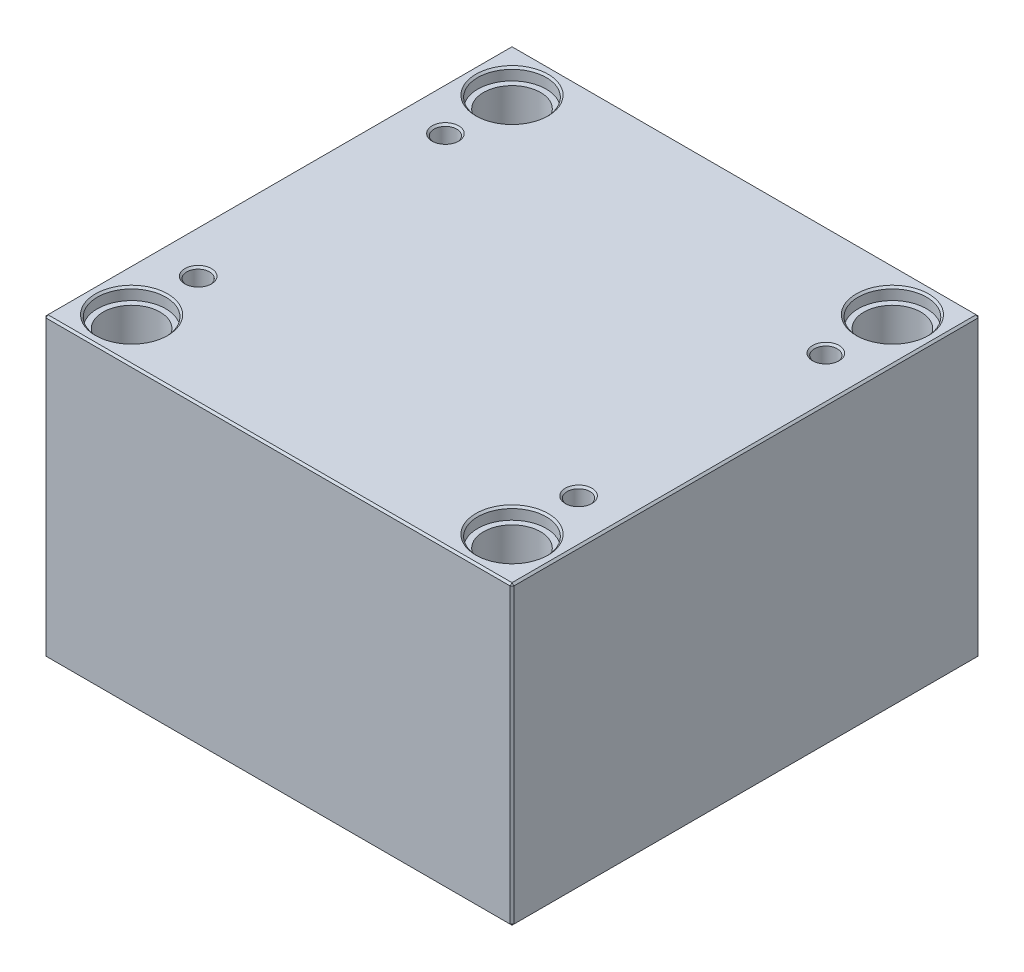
ISO-10303-21;
HEADER;
FILE_DESCRIPTION(('STEP AP214'),'2;1');
FILE_NAME('part.step','',(''),(''),'','','');
FILE_SCHEMA(('AUTOMOTIVE_DESIGN { 1 0 10303 214 1 1 1 1 }'));
ENDSEC;
DATA;
#1=APPLICATION_CONTEXT('core data for automotive mechanical design processes');
#2=APPLICATION_PROTOCOL_DEFINITION('international standard','automotive_design',2000,#1);
#3=PRODUCT_CONTEXT('',#1,'mechanical');
#4=PRODUCT('Part','Part','',(#3));
#5=PRODUCT_RELATED_PRODUCT_CATEGORY('part','',(#4));
#6=PRODUCT_DEFINITION_FORMATION('','',#4);
#7=PRODUCT_DEFINITION_CONTEXT('part definition',#1,'design');
#8=PRODUCT_DEFINITION('design','',#6,#7);
#9=PRODUCT_DEFINITION_SHAPE('','',#8);
#10=(LENGTH_UNIT() NAMED_UNIT(*) SI_UNIT(.MILLI.,.METRE.));
#11=(NAMED_UNIT(*) PLANE_ANGLE_UNIT() SI_UNIT($,.RADIAN.));
#12=(NAMED_UNIT(*) SI_UNIT($,.STERADIAN.) SOLID_ANGLE_UNIT());
#13=UNCERTAINTY_MEASURE_WITH_UNIT(LENGTH_MEASURE(1.E-05),#10,'distance_accuracy_value','');
#14=(GEOMETRIC_REPRESENTATION_CONTEXT(3) GLOBAL_UNCERTAINTY_ASSIGNED_CONTEXT((#13)) GLOBAL_UNIT_ASSIGNED_CONTEXT((#10,
#11,#12)) REPRESENTATION_CONTEXT('',''));
#15=CARTESIAN_POINT('',(0.,0.,0.));
#16=DIRECTION('',(0.,0.,1.));
#17=DIRECTION('',(1.,0.,0.));
#18=AXIS2_PLACEMENT_3D('',#15,#16,#17);
#19=CARTESIAN_POINT('',(-100.,0.,-100.));
#20=DIRECTION('',(0.,1.,0.));
#21=DIRECTION('',(0.,0.,1.));
#22=AXIS2_PLACEMENT_3D('',#19,#20,#21);
#23=CYLINDRICAL_SURFACE('',#22,15.);
#24=CARTESIAN_POINT('',(-100.,1.00000000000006,-100.));
#25=DIRECTION('',(0.,1.,0.));
#26=DIRECTION('',(0.,0.,1.));
#27=AXIS2_PLACEMENT_3D('',#24,#25,#26);
#28=CIRCLE('',#27,15.);
#29=CARTESIAN_POINT('',(-100.,1.00000000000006,-85.));
#30=VERTEX_POINT('',#29);
#31=EDGE_CURVE('E472',#30,#30,#28,.F.);
#32=ORIENTED_EDGE('',*,*,#31,.T.);
#33=EDGE_LOOP('',(#32));
#34=FACE_BOUND('',#33,.T.);
#35=CARTESIAN_POINT('',(-100.,149.7,-100.));
#36=DIRECTION('',(0.,1.,0.));
#37=DIRECTION('',(0.,0.,1.));
#38=AXIS2_PLACEMENT_3D('',#35,#36,#37);
#39=CIRCLE('',#38,15.);
#40=CARTESIAN_POINT('',(-100.,149.7,-85.));
#41=VERTEX_POINT('',#40);
#42=EDGE_CURVE('E221',#41,#41,#39,.F.);
#43=ORIENTED_EDGE('',*,*,#42,.F.);
#44=EDGE_LOOP('',(#43));
#45=FACE_BOUND('',#44,.T.);
#46=ADVANCED_FACE('F16',(#34,#45),#23,.F.);
#47=CARTESIAN_POINT('',(100.,0.,-100.));
#48=DIRECTION('',(0.,1.,0.));
#49=DIRECTION('',(0.,0.,1.));
#50=AXIS2_PLACEMENT_3D('',#47,#48,#49);
#51=CYLINDRICAL_SURFACE('',#50,15.);
#52=CARTESIAN_POINT('',(100.,1.00000000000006,-100.));
#53=DIRECTION('',(0.,1.,0.));
#54=DIRECTION('',(0.,0.,1.));
#55=AXIS2_PLACEMENT_3D('',#52,#53,#54);
#56=CIRCLE('',#55,15.);
#57=CARTESIAN_POINT('',(100.,1.00000000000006,-85.));
#58=VERTEX_POINT('',#57);
#59=EDGE_CURVE('E474',#58,#58,#56,.F.);
#60=ORIENTED_EDGE('',*,*,#59,.T.);
#61=EDGE_LOOP('',(#60));
#62=FACE_BOUND('',#61,.T.);
#63=CARTESIAN_POINT('',(100.,149.7,-100.));
#64=DIRECTION('',(0.,1.,0.));
#65=DIRECTION('',(0.,0.,1.));
#66=AXIS2_PLACEMENT_3D('',#63,#64,#65);
#67=CIRCLE('',#66,15.);
#68=CARTESIAN_POINT('',(100.,149.7,-85.));
#69=VERTEX_POINT('',#68);
#70=EDGE_CURVE('E218',#69,#69,#67,.F.);
#71=ORIENTED_EDGE('',*,*,#70,.F.);
#72=EDGE_LOOP('',(#71));
#73=FACE_BOUND('',#72,.T.);
#74=ADVANCED_FACE('F263',(#62,#73),#51,.F.);
#75=CARTESIAN_POINT('',(100.,0.,100.));
#76=DIRECTION('',(0.,1.,0.));
#77=DIRECTION('',(0.,0.,1.));
#78=AXIS2_PLACEMENT_3D('',#75,#76,#77);
#79=CYLINDRICAL_SURFACE('',#78,15.);
#80=CARTESIAN_POINT('',(100.,1.00000000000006,100.));
#81=DIRECTION('',(0.,1.,0.));
#82=DIRECTION('',(0.,0.,1.));
#83=AXIS2_PLACEMENT_3D('',#80,#81,#82);
#84=CIRCLE('',#83,15.);
#85=CARTESIAN_POINT('',(100.,1.00000000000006,115.));
#86=VERTEX_POINT('',#85);
#87=EDGE_CURVE('E477',#86,#86,#84,.F.);
#88=ORIENTED_EDGE('',*,*,#87,.T.);
#89=EDGE_LOOP('',(#88));
#90=FACE_BOUND('',#89,.T.);
#91=CARTESIAN_POINT('',(100.,149.7,100.));
#92=DIRECTION('',(0.,1.,0.));
#93=DIRECTION('',(0.,0.,1.));
#94=AXIS2_PLACEMENT_3D('',#91,#92,#93);
#95=CIRCLE('',#94,15.);
#96=CARTESIAN_POINT('',(100.,149.7,115.));
#97=VERTEX_POINT('',#96);
#98=EDGE_CURVE('E214',#97,#97,#95,.F.);
#99=ORIENTED_EDGE('',*,*,#98,.F.);
#100=EDGE_LOOP('',(#99));
#101=FACE_BOUND('',#100,.T.);
#102=ADVANCED_FACE('F270',(#90,#101),#79,.F.);
#103=CARTESIAN_POINT('',(-100.,0.,100.));
#104=DIRECTION('',(0.,1.,0.));
#105=DIRECTION('',(0.,0.,1.));
#106=AXIS2_PLACEMENT_3D('',#103,#104,#105);
#107=CYLINDRICAL_SURFACE('',#106,15.);
#108=CARTESIAN_POINT('',(-100.,1.,100.));
#109=DIRECTION('',(0.,1.,0.));
#110=DIRECTION('',(0.,0.,1.));
#111=AXIS2_PLACEMENT_3D('',#108,#109,#110);
#112=CIRCLE('',#111,15.);
#113=CARTESIAN_POINT('',(-100.,1.,115.));
#114=VERTEX_POINT('',#113);
#115=EDGE_CURVE('E480',#114,#114,#112,.F.);
#116=ORIENTED_EDGE('',*,*,#115,.T.);
#117=EDGE_LOOP('',(#116));
#118=FACE_BOUND('',#117,.T.);
#119=CARTESIAN_POINT('',(-100.,149.7,100.));
#120=DIRECTION('',(0.,1.,0.));
#121=DIRECTION('',(0.,0.,1.));
#122=AXIS2_PLACEMENT_3D('',#119,#120,#121);
#123=CIRCLE('',#122,15.);
#124=CARTESIAN_POINT('',(-100.,149.7,115.));
#125=VERTEX_POINT('',#124);
#126=EDGE_CURVE('E211',#125,#125,#123,.F.);
#127=ORIENTED_EDGE('',*,*,#126,.F.);
#128=EDGE_LOOP('',(#127));
#129=FACE_BOUND('',#128,.T.);
#130=ADVANCED_FACE('F277',(#118,#129),#107,.F.);
#131=CARTESIAN_POINT('',(-123.,156.,123.));
#132=DIRECTION('',(1.,0.,0.));
#133=DIRECTION('',(0.,0.,-1.));
#134=AXIS2_PLACEMENT_3D('',#131,#132,#133);
#135=PLANE('',#134);
#136=DIRECTION('',(0.,-1.,0.));
#137=VECTOR('',#136,1.);
#138=CARTESIAN_POINT('',(-123.,156.,-122.));
#139=LINE('',#138,#137);
#140=CARTESIAN_POINT('',(-123.,155.,-122.));
#141=VERTEX_POINT('',#140);
#142=CARTESIAN_POINT('',(-123.,1.,-122.));
#143=VERTEX_POINT('',#142);
#144=EDGE_CURVE('E487',#141,#143,#139,.T.);
#145=ORIENTED_EDGE('',*,*,#144,.T.);
#146=DIRECTION('',(0.,0.,1.));
#147=VECTOR('',#146,1.);
#148=CARTESIAN_POINT('',(-123.,1.,123.));
#149=LINE('',#148,#147);
#150=CARTESIAN_POINT('',(-123.,1.,122.));
#151=VERTEX_POINT('',#150);
#152=EDGE_CURVE('E490',#143,#151,#149,.T.);
#153=ORIENTED_EDGE('',*,*,#152,.T.);
#154=DIRECTION('',(0.,1.,0.));
#155=VECTOR('',#154,1.);
#156=CARTESIAN_POINT('',(-123.,156.,122.));
#157=LINE('',#156,#155);
#158=CARTESIAN_POINT('',(-123.,155.,122.));
#159=VERTEX_POINT('',#158);
#160=EDGE_CURVE('E485',#151,#159,#157,.T.);
#161=ORIENTED_EDGE('',*,*,#160,.T.);
#162=DIRECTION('',(0.,0.,-1.));
#163=VECTOR('',#162,1.);
#164=CARTESIAN_POINT('',(-123.,155.,-123.));
#165=LINE('',#164,#163);
#166=EDGE_CURVE('E483',#159,#141,#165,.T.);
#167=ORIENTED_EDGE('',*,*,#166,.T.);
#168=EDGE_LOOP('',(#145,#153,#161,#167));
#169=FACE_BOUND('',#168,.T.);
#170=ADVANCED_FACE('F298',(#169),#135,.F.);
#171=CARTESIAN_POINT('',(123.,156.,123.));
#172=DIRECTION('',(0.,0.,-1.));
#173=DIRECTION('',(-1.,0.,0.));
#174=AXIS2_PLACEMENT_3D('',#171,#172,#173);
#175=PLANE('',#174);
#176=DIRECTION('',(-1.,0.,0.));
#177=VECTOR('',#176,1.);
#178=CARTESIAN_POINT('',(-123.,155.,123.));
#179=LINE('',#178,#177);
#180=CARTESIAN_POINT('',(122.,155.,123.));
#181=VERTEX_POINT('',#180);
#182=CARTESIAN_POINT('',(-122.,155.,123.));
#183=VERTEX_POINT('',#182);
#184=EDGE_CURVE('E509',#181,#183,#179,.T.);
#185=ORIENTED_EDGE('',*,*,#184,.T.);
#186=DIRECTION('',(0.,-1.,0.));
#187=VECTOR('',#186,1.);
#188=CARTESIAN_POINT('',(-122.,156.,123.));
#189=LINE('',#188,#187);
#190=CARTESIAN_POINT('',(-122.,1.,123.));
#191=VERTEX_POINT('',#190);
#192=EDGE_CURVE('E515',#183,#191,#189,.T.);
#193=ORIENTED_EDGE('',*,*,#192,.T.);
#194=DIRECTION('',(1.,0.,0.));
#195=VECTOR('',#194,1.);
#196=CARTESIAN_POINT('',(123.,1.,123.));
#197=LINE('',#196,#195);
#198=CARTESIAN_POINT('',(122.,1.,123.));
#199=VERTEX_POINT('',#198);
#200=EDGE_CURVE('E513',#191,#199,#197,.T.);
#201=ORIENTED_EDGE('',*,*,#200,.T.);
#202=DIRECTION('',(0.,1.,0.));
#203=VECTOR('',#202,1.);
#204=CARTESIAN_POINT('',(122.,156.,123.));
#205=LINE('',#204,#203);
#206=EDGE_CURVE('E511',#199,#181,#205,.T.);
#207=ORIENTED_EDGE('',*,*,#206,.T.);
#208=EDGE_LOOP('',(#185,#193,#201,#207));
#209=FACE_BOUND('',#208,.T.);
#210=ADVANCED_FACE('F294',(#209),#175,.F.);
#211=CARTESIAN_POINT('',(123.,156.,123.));
#212=DIRECTION('',(-1.,0.,0.));
#213=DIRECTION('',(0.,0.,1.));
#214=AXIS2_PLACEMENT_3D('',#211,#212,#213);
#215=PLANE('',#214);
#216=DIRECTION('',(0.,0.,-1.));
#217=VECTOR('',#216,1.);
#218=CARTESIAN_POINT('',(123.,1.,123.));
#219=LINE('',#218,#217);
#220=CARTESIAN_POINT('',(123.,1.,122.));
#221=VERTEX_POINT('',#220);
#222=CARTESIAN_POINT('',(123.,1.,-122.));
#223=VERTEX_POINT('',#222);
#224=EDGE_CURVE('E504',#221,#223,#219,.T.);
#225=ORIENTED_EDGE('',*,*,#224,.T.);
#226=DIRECTION('',(0.,1.,0.));
#227=VECTOR('',#226,1.);
#228=CARTESIAN_POINT('',(123.,156.,-122.));
#229=LINE('',#228,#227);
#230=CARTESIAN_POINT('',(123.,155.,-122.));
#231=VERTEX_POINT('',#230);
#232=EDGE_CURVE('E506',#223,#231,#229,.T.);
#233=ORIENTED_EDGE('',*,*,#232,.T.);
#234=DIRECTION('',(0.,0.,1.));
#235=VECTOR('',#234,1.);
#236=CARTESIAN_POINT('',(123.,155.,123.));
#237=LINE('',#236,#235);
#238=CARTESIAN_POINT('',(123.,155.,122.));
#239=VERTEX_POINT('',#238);
#240=EDGE_CURVE('E500',#231,#239,#237,.T.);
#241=ORIENTED_EDGE('',*,*,#240,.T.);
#242=DIRECTION('',(0.,-1.,0.));
#243=VECTOR('',#242,1.);
#244=CARTESIAN_POINT('',(123.,156.,122.));
#245=LINE('',#244,#243);
#246=EDGE_CURVE('E502',#239,#221,#245,.T.);
#247=ORIENTED_EDGE('',*,*,#246,.T.);
#248=EDGE_LOOP('',(#225,#233,#241,#247));
#249=FACE_BOUND('',#248,.T.);
#250=ADVANCED_FACE('F290',(#249),#215,.F.);
#251=CARTESIAN_POINT('',(123.,156.,-123.));
#252=DIRECTION('',(0.,0.,1.));
#253=DIRECTION('',(1.,0.,0.));
#254=AXIS2_PLACEMENT_3D('',#251,#252,#253);
#255=PLANE('',#254);
#256=DIRECTION('',(0.,-1.,0.));
#257=VECTOR('',#256,1.);
#258=CARTESIAN_POINT('',(122.,156.,-123.));
#259=LINE('',#258,#257);
#260=CARTESIAN_POINT('',(122.,155.,-123.));
#261=VERTEX_POINT('',#260);
#262=CARTESIAN_POINT('',(122.,1.,-123.));
#263=VERTEX_POINT('',#262);
#264=EDGE_CURVE('E494',#261,#263,#259,.T.);
#265=ORIENTED_EDGE('',*,*,#264,.T.);
#266=DIRECTION('',(-1.,0.,0.));
#267=VECTOR('',#266,1.);
#268=CARTESIAN_POINT('',(123.,1.,-123.));
#269=LINE('',#268,#267);
#270=CARTESIAN_POINT('',(-122.,1.,-123.));
#271=VERTEX_POINT('',#270);
#272=EDGE_CURVE('E138',#263,#271,#269,.T.);
#273=ORIENTED_EDGE('',*,*,#272,.T.);
#274=DIRECTION('',(0.,1.,0.));
#275=VECTOR('',#274,1.);
#276=CARTESIAN_POINT('',(-122.,156.,-123.));
#277=LINE('',#276,#275);
#278=CARTESIAN_POINT('',(-122.,155.,-123.));
#279=VERTEX_POINT('',#278);
#280=EDGE_CURVE('E496',#271,#279,#277,.T.);
#281=ORIENTED_EDGE('',*,*,#280,.T.);
#282=DIRECTION('',(1.,0.,0.));
#283=VECTOR('',#282,1.);
#284=CARTESIAN_POINT('',(123.,155.,-123.));
#285=LINE('',#284,#283);
#286=EDGE_CURVE('E492',#279,#261,#285,.T.);
#287=ORIENTED_EDGE('',*,*,#286,.T.);
#288=EDGE_LOOP('',(#265,#273,#281,#287));
#289=FACE_BOUND('',#288,.T.);
#290=ADVANCED_FACE('F282',(#289),#255,.F.);
#291=CARTESIAN_POINT('',(0.,156.,0.));
#292=DIRECTION('',(0.,1.,0.));
#293=DIRECTION('',(0.,0.,1.));
#294=AXIS2_PLACEMENT_3D('',#291,#292,#293);
#295=PLANE('',#294);
#296=CARTESIAN_POINT('',(100.,156.,100.));
#297=DIRECTION('',(0.,1.,0.));
#298=DIRECTION('',(0.,0.,1.));
#299=AXIS2_PLACEMENT_3D('',#296,#297,#298);
#300=CIRCLE('',#299,19.);
#301=CARTESIAN_POINT('',(100.,156.,119.));
#302=VERTEX_POINT('',#301);
#303=EDGE_CURVE('E236',#302,#302,#300,.F.);
#304=ORIENTED_EDGE('',*,*,#303,.T.);
#305=EDGE_LOOP('',(#304));
#306=FACE_BOUND('',#305,.T.);
#307=CARTESIAN_POINT('',(-100.,156.,100.));
#308=DIRECTION('',(0.,1.,0.));
#309=DIRECTION('',(0.,0.,1.));
#310=AXIS2_PLACEMENT_3D('',#307,#308,#309);
#311=CIRCLE('',#310,19.);
#312=CARTESIAN_POINT('',(-100.,156.,119.));
#313=VERTEX_POINT('',#312);
#314=EDGE_CURVE('E233',#313,#313,#311,.F.);
#315=ORIENTED_EDGE('',*,*,#314,.T.);
#316=EDGE_LOOP('',(#315));
#317=FACE_BOUND('',#316,.T.);
#318=CARTESIAN_POINT('',(100.,156.,-100.));
#319=DIRECTION('',(0.,1.,0.));
#320=DIRECTION('',(0.,0.,1.));
#321=AXIS2_PLACEMENT_3D('',#318,#319,#320);
#322=CIRCLE('',#321,19.);
#323=CARTESIAN_POINT('',(100.,156.,-81.));
#324=VERTEX_POINT('',#323);
#325=EDGE_CURVE('E230',#324,#324,#322,.F.);
#326=ORIENTED_EDGE('',*,*,#325,.T.);
#327=EDGE_LOOP('',(#326));
#328=FACE_BOUND('',#327,.T.);
#329=CARTESIAN_POINT('',(-100.,156.,-100.));
#330=DIRECTION('',(0.,1.,0.));
#331=DIRECTION('',(0.,0.,1.));
#332=AXIS2_PLACEMENT_3D('',#329,#330,#331);
#333=CIRCLE('',#332,19.);
#334=CARTESIAN_POINT('',(-100.,156.,-81.));
#335=VERTEX_POINT('',#334);
#336=EDGE_CURVE('E227',#335,#335,#333,.F.);
#337=ORIENTED_EDGE('',*,*,#336,.T.);
#338=EDGE_LOOP('',(#337));
#339=FACE_BOUND('',#338,.T.);
#340=CARTESIAN_POINT('',(-100.,156.,65.));
#341=DIRECTION('',(0.,1.,0.));
#342=DIRECTION('',(0.,0.,1.));
#343=AXIS2_PLACEMENT_3D('',#340,#341,#342);
#344=CIRCLE('',#343,7.);
#345=CARTESIAN_POINT('',(-100.,156.,72.));
#346=VERTEX_POINT('',#345);
#347=EDGE_CURVE('E198',#346,#346,#344,.F.);
#348=ORIENTED_EDGE('',*,*,#347,.T.);
#349=EDGE_LOOP('',(#348));
#350=FACE_BOUND('',#349,.T.);
#351=CARTESIAN_POINT('',(100.,156.,65.));
#352=DIRECTION('',(0.,1.,0.));
#353=DIRECTION('',(0.,0.,1.));
#354=AXIS2_PLACEMENT_3D('',#351,#352,#353);
#355=CIRCLE('',#354,7.);
#356=CARTESIAN_POINT('',(100.,156.,72.));
#357=VERTEX_POINT('',#356);
#358=EDGE_CURVE('E195',#357,#357,#355,.F.);
#359=ORIENTED_EDGE('',*,*,#358,.T.);
#360=EDGE_LOOP('',(#359));
#361=FACE_BOUND('',#360,.T.);
#362=CARTESIAN_POINT('',(100.,156.,-65.));
#363=DIRECTION('',(0.,1.,0.));
#364=DIRECTION('',(0.,0.,1.));
#365=AXIS2_PLACEMENT_3D('',#362,#363,#364);
#366=CIRCLE('',#365,7.);
#367=CARTESIAN_POINT('',(100.,156.,-58.));
#368=VERTEX_POINT('',#367);
#369=EDGE_CURVE('E192',#368,#368,#366,.F.);
#370=ORIENTED_EDGE('',*,*,#369,.T.);
#371=EDGE_LOOP('',(#370));
#372=FACE_BOUND('',#371,.T.);
#373=CARTESIAN_POINT('',(-100.,156.,-65.));
#374=DIRECTION('',(0.,1.,0.));
#375=DIRECTION('',(0.,0.,1.));
#376=AXIS2_PLACEMENT_3D('',#373,#374,#375);
#377=CIRCLE('',#376,7.);
#378=CARTESIAN_POINT('',(-100.,156.,-58.));
#379=VERTEX_POINT('',#378);
#380=EDGE_CURVE('E188',#379,#379,#377,.F.);
#381=ORIENTED_EDGE('',*,*,#380,.T.);
#382=EDGE_LOOP('',(#381));
#383=FACE_BOUND('',#382,.T.);
#384=DIRECTION('',(0.,0.,-1.));
#385=VECTOR('',#384,1.);
#386=CARTESIAN_POINT('',(122.,156.,-123.));
#387=LINE('',#386,#385);
#388=CARTESIAN_POINT('',(122.,156.,122.));
#389=VERTEX_POINT('',#388);
#390=CARTESIAN_POINT('',(122.,156.,-122.));
#391=VERTEX_POINT('',#390);
#392=EDGE_CURVE('E31',#389,#391,#387,.T.);
#393=ORIENTED_EDGE('',*,*,#392,.T.);
#394=DIRECTION('',(-1.,0.,0.));
#395=VECTOR('',#394,1.);
#396=CARTESIAN_POINT('',(-123.,156.,-122.));
#397=LINE('',#396,#395);
#398=CARTESIAN_POINT('',(-122.,156.,-122.));
#399=VERTEX_POINT('',#398);
#400=EDGE_CURVE('E189',#391,#399,#397,.T.);
#401=ORIENTED_EDGE('',*,*,#400,.T.);
#402=DIRECTION('',(0.,0.,1.));
#403=VECTOR('',#402,1.);
#404=CARTESIAN_POINT('',(-122.,156.,123.));
#405=LINE('',#404,#403);
#406=CARTESIAN_POINT('',(-122.,156.,122.));
#407=VERTEX_POINT('',#406);
#408=EDGE_CURVE('E518',#399,#407,#405,.T.);
#409=ORIENTED_EDGE('',*,*,#408,.T.);
#410=DIRECTION('',(1.,0.,0.));
#411=VECTOR('',#410,1.);
#412=CARTESIAN_POINT('',(123.,156.,122.));
#413=LINE('',#412,#411);
#414=EDGE_CURVE('E36',#407,#389,#413,.T.);
#415=ORIENTED_EDGE('',*,*,#414,.T.);
#416=EDGE_LOOP('',(#393,#401,#409,#415));
#417=FACE_BOUND('',#416,.T.);
#418=ADVANCED_FACE('F279',(#306,#317,#328,#339,#350,#361,#372,#383,#417),#295,.T.);
#419=CARTESIAN_POINT('',(0.,0.,0.));
#420=DIRECTION('',(0.,1.,0.));
#421=DIRECTION('',(0.,0.,1.));
#422=AXIS2_PLACEMENT_3D('',#419,#420,#421);
#423=PLANE('',#422);
#424=CARTESIAN_POINT('',(-100.,0.,-100.));
#425=DIRECTION('',(0.,1.,0.));
#426=DIRECTION('',(0.,0.,1.));
#427=AXIS2_PLACEMENT_3D('',#424,#425,#426);
#428=CIRCLE('',#427,16.);
#429=CARTESIAN_POINT('',(-100.,0.,-84.));
#430=VERTEX_POINT('',#429);
#431=EDGE_CURVE('E469',#430,#430,#428,.T.);
#432=ORIENTED_EDGE('',*,*,#431,.T.);
#433=EDGE_LOOP('',(#432));
#434=FACE_BOUND('',#433,.T.);
#435=CARTESIAN_POINT('',(100.,0.,-100.));
#436=DIRECTION('',(0.,1.,0.));
#437=DIRECTION('',(0.,0.,1.));
#438=AXIS2_PLACEMENT_3D('',#435,#436,#437);
#439=CIRCLE('',#438,16.);
#440=CARTESIAN_POINT('',(100.,0.,-84.));
#441=VERTEX_POINT('',#440);
#442=EDGE_CURVE('E466',#441,#441,#439,.T.);
#443=ORIENTED_EDGE('',*,*,#442,.T.);
#444=EDGE_LOOP('',(#443));
#445=FACE_BOUND('',#444,.T.);
#446=CARTESIAN_POINT('',(100.,0.,100.));
#447=DIRECTION('',(0.,1.,0.));
#448=DIRECTION('',(0.,0.,1.));
#449=AXIS2_PLACEMENT_3D('',#446,#447,#448);
#450=CIRCLE('',#449,16.);
#451=CARTESIAN_POINT('',(100.,0.,116.));
#452=VERTEX_POINT('',#451);
#453=EDGE_CURVE('E463',#452,#452,#450,.T.);
#454=ORIENTED_EDGE('',*,*,#453,.T.);
#455=EDGE_LOOP('',(#454));
#456=FACE_BOUND('',#455,.T.);
#457=CARTESIAN_POINT('',(-100.,0.,100.));
#458=DIRECTION('',(0.,1.,0.));
#459=DIRECTION('',(0.,0.,1.));
#460=AXIS2_PLACEMENT_3D('',#457,#458,#459);
#461=CIRCLE('',#460,16.);
#462=CARTESIAN_POINT('',(-100.,0.,116.));
#463=VERTEX_POINT('',#462);
#464=EDGE_CURVE('E460',#463,#463,#461,.T.);
#465=ORIENTED_EDGE('',*,*,#464,.T.);
#466=EDGE_LOOP('',(#465));
#467=FACE_BOUND('',#466,.T.);
#468=DIRECTION('',(0.,0.,1.));
#469=VECTOR('',#468,1.);
#470=CARTESIAN_POINT('',(122.,0.,0.));
#471=LINE('',#470,#469);
#472=CARTESIAN_POINT('',(122.,0.,-122.));
#473=VERTEX_POINT('',#472);
#474=CARTESIAN_POINT('',(122.,0.,122.));
#475=VERTEX_POINT('',#474);
#476=EDGE_CURVE('E108',#473,#475,#471,.T.);
#477=ORIENTED_EDGE('',*,*,#476,.T.);
#478=DIRECTION('',(-1.,0.,0.));
#479=VECTOR('',#478,1.);
#480=CARTESIAN_POINT('',(0.,0.,122.));
#481=LINE('',#480,#479);
#482=CARTESIAN_POINT('',(-122.,0.,122.));
#483=VERTEX_POINT('',#482);
#484=EDGE_CURVE('E458',#475,#483,#481,.T.);
#485=ORIENTED_EDGE('',*,*,#484,.T.);
#486=DIRECTION('',(0.,0.,-1.));
#487=VECTOR('',#486,1.);
#488=CARTESIAN_POINT('',(-122.,0.,0.));
#489=LINE('',#488,#487);
#490=CARTESIAN_POINT('',(-122.,0.,-122.));
#491=VERTEX_POINT('',#490);
#492=EDGE_CURVE('E110',#483,#491,#489,.T.);
#493=ORIENTED_EDGE('',*,*,#492,.T.);
#494=DIRECTION('',(1.,0.,0.));
#495=VECTOR('',#494,1.);
#496=CARTESIAN_POINT('',(0.,0.,-122.));
#497=LINE('',#496,#495);
#498=EDGE_CURVE('E104',#491,#473,#497,.T.);
#499=ORIENTED_EDGE('',*,*,#498,.T.);
#500=EDGE_LOOP('',(#477,#485,#493,#499));
#501=FACE_BOUND('',#500,.T.);
#502=ADVANCED_FACE('F106',(#434,#445,#456,#467,#501),#423,.F.);
#503=CARTESIAN_POINT('',(-100.,0.,-100.));
#504=DIRECTION('',(0.,-1.,0.));
#505=DIRECTION('',(0.,0.,-1.));
#506=AXIS2_PLACEMENT_3D('',#503,#504,#505);
#507=CONICAL_SURFACE('',#506,16.,0.785398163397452);
#508=ORIENTED_EDGE('',*,*,#31,.F.);
#509=EDGE_LOOP('',(#508));
#510=FACE_BOUND('',#509,.T.);
#511=ORIENTED_EDGE('',*,*,#431,.F.);
#512=EDGE_LOOP('',(#511));
#513=FACE_BOUND('',#512,.T.);
#514=ADVANCED_FACE('F286',(#510,#513),#507,.F.);
#515=CARTESIAN_POINT('',(100.,0.,-100.));
#516=DIRECTION('',(0.,-1.,0.));
#517=DIRECTION('',(0.,0.,-1.));
#518=AXIS2_PLACEMENT_3D('',#515,#516,#517);
#519=CONICAL_SURFACE('',#518,16.,0.785398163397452);
#520=ORIENTED_EDGE('',*,*,#59,.F.);
#521=EDGE_LOOP('',(#520));
#522=FACE_BOUND('',#521,.T.);
#523=ORIENTED_EDGE('',*,*,#442,.F.);
#524=EDGE_LOOP('',(#523));
#525=FACE_BOUND('',#524,.T.);
#526=ADVANCED_FACE('F305',(#522,#525),#519,.F.);
#527=CARTESIAN_POINT('',(100.,0.,100.));
#528=DIRECTION('',(0.,-1.,0.));
#529=DIRECTION('',(0.,0.,-1.));
#530=AXIS2_PLACEMENT_3D('',#527,#528,#529);
#531=CONICAL_SURFACE('',#530,16.,0.785398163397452);
#532=ORIENTED_EDGE('',*,*,#87,.F.);
#533=EDGE_LOOP('',(#532));
#534=FACE_BOUND('',#533,.T.);
#535=ORIENTED_EDGE('',*,*,#453,.F.);
#536=EDGE_LOOP('',(#535));
#537=FACE_BOUND('',#536,.T.);
#538=ADVANCED_FACE('F309',(#534,#537),#531,.F.);
#539=CARTESIAN_POINT('',(-100.,0.,100.));
#540=DIRECTION('',(0.,-1.,0.));
#541=DIRECTION('',(0.,0.,-1.));
#542=AXIS2_PLACEMENT_3D('',#539,#540,#541);
#543=CONICAL_SURFACE('',#542,16.,0.785398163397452);
#544=ORIENTED_EDGE('',*,*,#115,.F.);
#545=EDGE_LOOP('',(#544));
#546=FACE_BOUND('',#545,.T.);
#547=ORIENTED_EDGE('',*,*,#464,.F.);
#548=EDGE_LOOP('',(#547));
#549=FACE_BOUND('',#548,.T.);
#550=ADVANCED_FACE('F313',(#546,#549),#543,.F.);
#551=CARTESIAN_POINT('',(123.,156.,122.));
#552=DIRECTION('',(-0.707106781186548,0.,-0.707106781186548));
#553=DIRECTION('',(0.,-1.,0.));
#554=AXIS2_PLACEMENT_3D('',#551,#552,#553);
#555=PLANE('',#554);
#556=DIRECTION('',(-0.707106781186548,0.,0.707106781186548));
#557=VECTOR('',#556,1.);
#558=CARTESIAN_POINT('',(122.,155.,123.));
#559=LINE('',#558,#557);
#560=EDGE_CURVE('E126',#181,#239,#559,.F.);
#561=ORIENTED_EDGE('',*,*,#560,.F.);
#562=ORIENTED_EDGE('',*,*,#206,.F.);
#563=DIRECTION('',(0.707106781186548,0.,-0.707106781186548));
#564=VECTOR('',#563,1.);
#565=CARTESIAN_POINT('',(122.,1.,123.));
#566=LINE('',#565,#564);
#567=EDGE_CURVE('E180',#221,#199,#566,.F.);
#568=ORIENTED_EDGE('',*,*,#567,.F.);
#569=ORIENTED_EDGE('',*,*,#246,.F.);
#570=EDGE_LOOP('',(#561,#562,#568,#569));
#571=FACE_BOUND('',#570,.T.);
#572=ADVANCED_FACE('F317',(#571),#555,.F.);
#573=CARTESIAN_POINT('',(122.,155.,123.));
#574=DIRECTION('',(0.577350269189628,0.57735026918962,0.577350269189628));
#575=DIRECTION('',(0.707106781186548,0.,-0.707106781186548));
#576=AXIS2_PLACEMENT_3D('',#573,#574,#575);
#577=PLANE('',#576);
#578=DIRECTION('',(0.,-0.70710678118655,0.707106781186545));
#579=VECTOR('',#578,1.);
#580=CARTESIAN_POINT('',(122.,155.,123.));
#581=LINE('',#580,#579);
#582=EDGE_CURVE('E175',#181,#389,#581,.F.);
#583=ORIENTED_EDGE('',*,*,#582,.F.);
#584=ORIENTED_EDGE('',*,*,#560,.T.);
#585=DIRECTION('',(-0.707106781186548,0.707106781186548,0.));
#586=VECTOR('',#585,1.);
#587=CARTESIAN_POINT('',(122.5,155.5,122.));
#588=LINE('',#587,#586);
#589=EDGE_CURVE('E177',#389,#239,#588,.F.);
#590=ORIENTED_EDGE('',*,*,#589,.F.);
#591=EDGE_LOOP('',(#583,#584,#590));
#592=FACE_BOUND('',#591,.T.);
#593=ADVANCED_FACE('F385',(#592),#577,.T.);
#594=CARTESIAN_POINT('',(122.,1.,123.));
#595=DIRECTION('',(0.577350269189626,-0.577350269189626,0.577350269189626));
#596=DIRECTION('',(0.707106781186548,0.,-0.707106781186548));
#597=AXIS2_PLACEMENT_3D('',#594,#595,#596);
#598=PLANE('',#597);
#599=DIRECTION('',(-0.707106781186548,-0.707106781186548,0.));
#600=VECTOR('',#599,1.);
#601=CARTESIAN_POINT('',(122.5,0.5,122.));
#602=LINE('',#601,#600);
#603=EDGE_CURVE('E124',#221,#475,#602,.T.);
#604=ORIENTED_EDGE('',*,*,#603,.F.);
#605=ORIENTED_EDGE('',*,*,#567,.T.);
#606=DIRECTION('',(0.,0.70710678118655,0.707106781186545));
#607=VECTOR('',#606,1.);
#608=CARTESIAN_POINT('',(122.,1.,123.));
#609=LINE('',#608,#607);
#610=EDGE_CURVE('E172',#475,#199,#609,.T.);
#611=ORIENTED_EDGE('',*,*,#610,.F.);
#612=EDGE_LOOP('',(#604,#605,#611));
#613=FACE_BOUND('',#612,.T.);
#614=ADVANCED_FACE('F381',(#613),#598,.T.);
#615=CARTESIAN_POINT('',(122.,156.,0.));
#616=DIRECTION('',(0.707106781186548,0.707106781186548,0.));
#617=DIRECTION('',(0.,0.,1.));
#618=AXIS2_PLACEMENT_3D('',#615,#616,#617);
#619=PLANE('',#618);
#620=ORIENTED_EDGE('',*,*,#589,.T.);
#621=ORIENTED_EDGE('',*,*,#240,.F.);
#622=DIRECTION('',(0.707106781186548,-0.707106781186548,0.));
#623=VECTOR('',#622,1.);
#624=CARTESIAN_POINT('',(123.,155.,-122.));
#625=LINE('',#624,#623);
#626=EDGE_CURVE('E166',#391,#231,#625,.T.);
#627=ORIENTED_EDGE('',*,*,#626,.F.);
#628=ORIENTED_EDGE('',*,*,#392,.F.);
#629=EDGE_LOOP('',(#620,#621,#627,#628));
#630=FACE_BOUND('',#629,.T.);
#631=ADVANCED_FACE('F377',(#630),#619,.T.);
#632=CARTESIAN_POINT('',(0.,156.,122.));
#633=DIRECTION('',(0.,0.707106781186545,0.70710678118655));
#634=DIRECTION('',(-1.,0.,0.));
#635=AXIS2_PLACEMENT_3D('',#632,#633,#634);
#636=PLANE('',#635);
#637=ORIENTED_EDGE('',*,*,#582,.T.);
#638=ORIENTED_EDGE('',*,*,#414,.F.);
#639=DIRECTION('',(0.,0.70710678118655,-0.707106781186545));
#640=VECTOR('',#639,1.);
#641=CARTESIAN_POINT('',(-122.,155.5,122.5));
#642=LINE('',#641,#640);
#643=EDGE_CURVE('E163',#183,#407,#642,.T.);
#644=ORIENTED_EDGE('',*,*,#643,.F.);
#645=ORIENTED_EDGE('',*,*,#184,.F.);
#646=EDGE_LOOP('',(#637,#638,#644,#645));
#647=FACE_BOUND('',#646,.T.);
#648=ADVANCED_FACE('F373',(#647),#636,.T.);
#649=CARTESIAN_POINT('',(-122.,156.,123.));
#650=DIRECTION('',(0.707106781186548,0.,-0.707106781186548));
#651=DIRECTION('',(0.,-1.,0.));
#652=AXIS2_PLACEMENT_3D('',#649,#650,#651);
#653=PLANE('',#652);
#654=DIRECTION('',(0.707106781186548,0.,0.707106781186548));
#655=VECTOR('',#654,1.);
#656=CARTESIAN_POINT('',(-122.,1.,123.));
#657=LINE('',#656,#655);
#658=EDGE_CURVE('E157',#191,#151,#657,.F.);
#659=ORIENTED_EDGE('',*,*,#658,.F.);
#660=ORIENTED_EDGE('',*,*,#192,.F.);
#661=DIRECTION('',(-0.707106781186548,0.,-0.707106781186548));
#662=VECTOR('',#661,1.);
#663=CARTESIAN_POINT('',(-123.,155.,122.));
#664=LINE('',#663,#662);
#665=EDGE_CURVE('E160',#159,#183,#664,.F.);
#666=ORIENTED_EDGE('',*,*,#665,.F.);
#667=ORIENTED_EDGE('',*,*,#160,.F.);
#668=EDGE_LOOP('',(#659,#660,#666,#667));
#669=FACE_BOUND('',#668,.T.);
#670=ADVANCED_FACE('F369',(#669),#653,.F.);
#671=CARTESIAN_POINT('',(123.,1.,123.));
#672=DIRECTION('',(0.,0.707106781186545,-0.70710678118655));
#673=DIRECTION('',(1.,0.,0.));
#674=AXIS2_PLACEMENT_3D('',#671,#672,#673);
#675=PLANE('',#674);
#676=ORIENTED_EDGE('',*,*,#610,.T.);
#677=ORIENTED_EDGE('',*,*,#200,.F.);
#678=DIRECTION('',(0.,-0.70710678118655,-0.707106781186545));
#679=VECTOR('',#678,1.);
#680=CARTESIAN_POINT('',(-122.,1.,123.));
#681=LINE('',#680,#679);
#682=EDGE_CURVE('E135',#483,#191,#681,.F.);
#683=ORIENTED_EDGE('',*,*,#682,.F.);
#684=ORIENTED_EDGE('',*,*,#484,.F.);
#685=EDGE_LOOP('',(#676,#677,#683,#684));
#686=FACE_BOUND('',#685,.T.);
#687=ADVANCED_FACE('F366',(#686),#675,.F.);
#688=CARTESIAN_POINT('',(123.,1.,123.));
#689=DIRECTION('',(-0.707106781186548,0.707106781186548,0.));
#690=DIRECTION('',(0.,0.,-1.));
#691=AXIS2_PLACEMENT_3D('',#688,#689,#690);
#692=PLANE('',#691);
#693=ORIENTED_EDGE('',*,*,#603,.T.);
#694=ORIENTED_EDGE('',*,*,#476,.F.);
#695=DIRECTION('',(0.707106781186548,0.707106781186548,0.));
#696=VECTOR('',#695,1.);
#697=CARTESIAN_POINT('',(122.5,0.499999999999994,-122.));
#698=LINE('',#697,#696);
#699=EDGE_CURVE('E121',#223,#473,#698,.F.);
#700=ORIENTED_EDGE('',*,*,#699,.F.);
#701=ORIENTED_EDGE('',*,*,#224,.F.);
#702=EDGE_LOOP('',(#693,#694,#700,#701));
#703=FACE_BOUND('',#702,.T.);
#704=ADVANCED_FACE('F119',(#703),#692,.F.);
#705=CARTESIAN_POINT('',(122.,156.,-123.));
#706=DIRECTION('',(-0.707106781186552,0.,0.707106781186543));
#707=DIRECTION('',(0.,-1.,0.));
#708=AXIS2_PLACEMENT_3D('',#705,#706,#707);
#709=PLANE('',#708);
#710=DIRECTION('',(0.707106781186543,0.,0.707106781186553));
#711=VECTOR('',#710,1.);
#712=CARTESIAN_POINT('',(123.,155.,-122.));
#713=LINE('',#712,#711);
#714=EDGE_CURVE('E168',#231,#261,#713,.F.);
#715=ORIENTED_EDGE('',*,*,#714,.F.);
#716=ORIENTED_EDGE('',*,*,#232,.F.);
#717=DIRECTION('',(-0.707106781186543,0.,-0.707106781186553));
#718=VECTOR('',#717,1.);
#719=CARTESIAN_POINT('',(122.,1.,-123.));
#720=LINE('',#719,#718);
#721=EDGE_CURVE('E134',#263,#223,#720,.F.);
#722=ORIENTED_EDGE('',*,*,#721,.F.);
#723=ORIENTED_EDGE('',*,*,#264,.F.);
#724=EDGE_LOOP('',(#715,#716,#722,#723));
#725=FACE_BOUND('',#724,.T.);
#726=ADVANCED_FACE('F359',(#725),#709,.F.);
#727=CARTESIAN_POINT('',(123.,155.,-122.));
#728=DIRECTION('',(0.577350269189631,0.577350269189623,-0.577350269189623));
#729=DIRECTION('',(-0.707106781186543,0.,-0.707106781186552));
#730=AXIS2_PLACEMENT_3D('',#727,#728,#729);
#731=PLANE('',#730);
#732=ORIENTED_EDGE('',*,*,#626,.T.);
#733=ORIENTED_EDGE('',*,*,#714,.T.);
#734=DIRECTION('',(0.,0.707106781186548,0.707106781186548));
#735=VECTOR('',#734,1.);
#736=CARTESIAN_POINT('',(122.,155.5,-122.5));
#737=LINE('',#736,#735);
#738=EDGE_CURVE('E152',#391,#261,#737,.F.);
#739=ORIENTED_EDGE('',*,*,#738,.F.);
#740=EDGE_LOOP('',(#732,#733,#739));
#741=FACE_BOUND('',#740,.T.);
#742=ADVANCED_FACE('F355',(#741),#731,.T.);
#743=CARTESIAN_POINT('',(-123.,155.,122.));
#744=DIRECTION('',(-0.577350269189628,0.57735026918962,0.577350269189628));
#745=DIRECTION('',(0.707106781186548,0.,0.707106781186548));
#746=AXIS2_PLACEMENT_3D('',#743,#744,#745);
#747=PLANE('',#746);
#748=ORIENTED_EDGE('',*,*,#665,.T.);
#749=ORIENTED_EDGE('',*,*,#643,.T.);
#750=DIRECTION('',(-0.707106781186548,-0.707106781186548,0.));
#751=VECTOR('',#750,1.);
#752=CARTESIAN_POINT('',(-123.,155.,122.));
#753=LINE('',#752,#751);
#754=EDGE_CURVE('E143',#159,#407,#753,.F.);
#755=ORIENTED_EDGE('',*,*,#754,.F.);
#756=EDGE_LOOP('',(#748,#749,#755));
#757=FACE_BOUND('',#756,.T.);
#758=ADVANCED_FACE('F351',(#757),#747,.T.);
#759=CARTESIAN_POINT('',(-122.,1.,123.));
#760=DIRECTION('',(-0.577350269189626,-0.577350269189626,0.577350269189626));
#761=DIRECTION('',(0.707106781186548,0.,0.707106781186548));
#762=AXIS2_PLACEMENT_3D('',#759,#760,#761);
#763=PLANE('',#762);
#764=ORIENTED_EDGE('',*,*,#682,.T.);
#765=ORIENTED_EDGE('',*,*,#658,.T.);
#766=DIRECTION('',(-0.707106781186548,0.707106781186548,0.));
#767=VECTOR('',#766,1.);
#768=CARTESIAN_POINT('',(-122.5,0.5,122.));
#769=LINE('',#768,#767);
#770=EDGE_CURVE('E139',#483,#151,#769,.T.);
#771=ORIENTED_EDGE('',*,*,#770,.F.);
#772=EDGE_LOOP('',(#764,#765,#771));
#773=FACE_BOUND('',#772,.T.);
#774=ADVANCED_FACE('F348',(#773),#763,.T.);
#775=CARTESIAN_POINT('',(122.,1.,-123.));
#776=DIRECTION('',(0.577350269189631,-0.577350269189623,-0.577350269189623));
#777=DIRECTION('',(-0.707106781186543,0.,-0.707106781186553));
#778=AXIS2_PLACEMENT_3D('',#775,#776,#777);
#779=PLANE('',#778);
#780=ORIENTED_EDGE('',*,*,#721,.T.);
#781=ORIENTED_EDGE('',*,*,#699,.T.);
#782=DIRECTION('',(0.,-0.707106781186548,0.707106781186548));
#783=VECTOR('',#782,1.);
#784=CARTESIAN_POINT('',(122.,1.,-123.));
#785=LINE('',#784,#783);
#786=EDGE_CURVE('E131',#263,#473,#785,.T.);
#787=ORIENTED_EDGE('',*,*,#786,.F.);
#788=EDGE_LOOP('',(#780,#781,#787));
#789=FACE_BOUND('',#788,.T.);
#790=ADVANCED_FACE('F130',(#789),#779,.T.);
#791=CARTESIAN_POINT('',(0.,156.,-122.));
#792=DIRECTION('',(0.,0.707106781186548,-0.707106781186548));
#793=DIRECTION('',(1.,0.,0.));
#794=AXIS2_PLACEMENT_3D('',#791,#792,#793);
#795=PLANE('',#794);
#796=ORIENTED_EDGE('',*,*,#738,.T.);
#797=ORIENTED_EDGE('',*,*,#286,.F.);
#798=DIRECTION('',(0.,-0.707106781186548,-0.707106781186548));
#799=VECTOR('',#798,1.);
#800=CARTESIAN_POINT('',(-122.,155.,-123.));
#801=LINE('',#800,#799);
#802=EDGE_CURVE('E140',#399,#279,#801,.T.);
#803=ORIENTED_EDGE('',*,*,#802,.F.);
#804=ORIENTED_EDGE('',*,*,#400,.F.);
#805=EDGE_LOOP('',(#796,#797,#803,#804));
#806=FACE_BOUND('',#805,.T.);
#807=ADVANCED_FACE('F341',(#806),#795,.T.);
#808=CARTESIAN_POINT('',(-122.,156.,0.));
#809=DIRECTION('',(-0.707106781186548,0.707106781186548,0.));
#810=DIRECTION('',(0.,0.,-1.));
#811=AXIS2_PLACEMENT_3D('',#808,#809,#810);
#812=PLANE('',#811);
#813=ORIENTED_EDGE('',*,*,#754,.T.);
#814=ORIENTED_EDGE('',*,*,#408,.F.);
#815=DIRECTION('',(0.707106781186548,0.707106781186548,0.));
#816=VECTOR('',#815,1.);
#817=CARTESIAN_POINT('',(-122.5,155.5,-122.));
#818=LINE('',#817,#816);
#819=EDGE_CURVE('E146',#141,#399,#818,.T.);
#820=ORIENTED_EDGE('',*,*,#819,.F.);
#821=ORIENTED_EDGE('',*,*,#166,.F.);
#822=EDGE_LOOP('',(#813,#814,#820,#821));
#823=FACE_BOUND('',#822,.T.);
#824=ADVANCED_FACE('F337',(#823),#812,.T.);
#825=CARTESIAN_POINT('',(-123.,1.,123.));
#826=DIRECTION('',(0.707106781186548,0.707106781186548,0.));
#827=DIRECTION('',(0.,0.,1.));
#828=AXIS2_PLACEMENT_3D('',#825,#826,#827);
#829=PLANE('',#828);
#830=ORIENTED_EDGE('',*,*,#770,.T.);
#831=ORIENTED_EDGE('',*,*,#152,.F.);
#832=DIRECTION('',(0.707106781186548,-0.707106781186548,0.));
#833=VECTOR('',#832,1.);
#834=CARTESIAN_POINT('',(-123.,1.,-122.));
#835=LINE('',#834,#833);
#836=EDGE_CURVE('E529',#491,#143,#835,.F.);
#837=ORIENTED_EDGE('',*,*,#836,.F.);
#838=ORIENTED_EDGE('',*,*,#492,.F.);
#839=EDGE_LOOP('',(#830,#831,#837,#838));
#840=FACE_BOUND('',#839,.T.);
#841=ADVANCED_FACE('F334',(#840),#829,.F.);
#842=CARTESIAN_POINT('',(123.,1.,-123.));
#843=DIRECTION('',(0.,0.707106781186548,0.707106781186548));
#844=DIRECTION('',(-1.,0.,0.));
#845=AXIS2_PLACEMENT_3D('',#842,#843,#844);
#846=PLANE('',#845);
#847=ORIENTED_EDGE('',*,*,#786,.T.);
#848=ORIENTED_EDGE('',*,*,#498,.F.);
#849=DIRECTION('',(0.,0.707106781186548,-0.707106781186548));
#850=VECTOR('',#849,1.);
#851=CARTESIAN_POINT('',(-122.,0.5,-122.5));
#852=LINE('',#851,#850);
#853=EDGE_CURVE('E526',#271,#491,#852,.F.);
#854=ORIENTED_EDGE('',*,*,#853,.F.);
#855=ORIENTED_EDGE('',*,*,#272,.F.);
#856=EDGE_LOOP('',(#847,#848,#854,#855));
#857=FACE_BOUND('',#856,.T.);
#858=ADVANCED_FACE('F137',(#857),#846,.F.);
#859=CARTESIAN_POINT('',(-122.,155.,-123.));
#860=DIRECTION('',(-0.577350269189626,0.577350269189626,-0.577350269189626));
#861=DIRECTION('',(-0.707106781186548,0.,0.707106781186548));
#862=AXIS2_PLACEMENT_3D('',#859,#860,#861);
#863=PLANE('',#862);
#864=ORIENTED_EDGE('',*,*,#819,.T.);
#865=ORIENTED_EDGE('',*,*,#802,.T.);
#866=DIRECTION('',(0.707106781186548,0.,-0.707106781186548));
#867=VECTOR('',#866,1.);
#868=CARTESIAN_POINT('',(-122.,155.,-123.));
#869=LINE('',#868,#867);
#870=EDGE_CURVE('E524',#141,#279,#869,.T.);
#871=ORIENTED_EDGE('',*,*,#870,.F.);
#872=EDGE_LOOP('',(#864,#865,#871));
#873=FACE_BOUND('',#872,.T.);
#874=ADVANCED_FACE('F327',(#873),#863,.T.);
#875=CARTESIAN_POINT('',(-123.,1.,-122.));
#876=DIRECTION('',(-0.577350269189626,-0.577350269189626,-0.577350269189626));
#877=DIRECTION('',(-0.707106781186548,0.,0.707106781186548));
#878=AXIS2_PLACEMENT_3D('',#875,#876,#877);
#879=PLANE('',#878);
#880=ORIENTED_EDGE('',*,*,#853,.T.);
#881=ORIENTED_EDGE('',*,*,#836,.T.);
#882=DIRECTION('',(-0.707106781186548,0.,0.707106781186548));
#883=VECTOR('',#882,1.);
#884=CARTESIAN_POINT('',(-123.,1.,-122.));
#885=LINE('',#884,#883);
#886=EDGE_CURVE('E455',#271,#143,#885,.T.);
#887=ORIENTED_EDGE('',*,*,#886,.F.);
#888=EDGE_LOOP('',(#880,#881,#887));
#889=FACE_BOUND('',#888,.T.);
#890=ADVANCED_FACE('F323',(#889),#879,.T.);
#891=CARTESIAN_POINT('',(-123.,156.,-122.));
#892=DIRECTION('',(0.707106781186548,0.,0.707106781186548));
#893=DIRECTION('',(0.,-1.,0.));
#894=AXIS2_PLACEMENT_3D('',#891,#892,#893);
#895=PLANE('',#894);
#896=ORIENTED_EDGE('',*,*,#870,.T.);
#897=ORIENTED_EDGE('',*,*,#280,.F.);
#898=ORIENTED_EDGE('',*,*,#886,.T.);
#899=ORIENTED_EDGE('',*,*,#144,.F.);
#900=EDGE_LOOP('',(#896,#897,#898,#899));
#901=FACE_BOUND('',#900,.T.);
#902=ADVANCED_FACE('F319',(#901),#895,.F.);
#903=CARTESIAN_POINT('',(-100.,132.,-65.));
#904=DIRECTION('',(0.,1.,0.));
#905=DIRECTION('',(0.,0.,1.));
#906=AXIS2_PLACEMENT_3D('',#903,#904,#905);
#907=CYLINDRICAL_SURFACE('',#906,6.);
#908=CARTESIAN_POINT('',(-100.,155.,-65.));
#909=DIRECTION('',(0.,1.,0.));
#910=DIRECTION('',(0.,0.,1.));
#911=AXIS2_PLACEMENT_3D('',#908,#909,#910);
#912=CIRCLE('',#911,6.);
#913=CARTESIAN_POINT('',(-100.,155.,-59.));
#914=VERTEX_POINT('',#913);
#915=EDGE_CURVE('E207',#914,#914,#912,.T.);
#916=ORIENTED_EDGE('',*,*,#915,.T.);
#917=EDGE_LOOP('',(#916));
#918=FACE_BOUND('',#917,.T.);
#919=CARTESIAN_POINT('',(-100.,132.,-65.));
#920=DIRECTION('',(0.,1.,0.));
#921=DIRECTION('',(0.,0.,1.));
#922=AXIS2_PLACEMENT_3D('',#919,#920,#921);
#923=CIRCLE('',#922,6.);
#924=CARTESIAN_POINT('',(-100.,132.,-59.));
#925=VERTEX_POINT('',#924);
#926=EDGE_CURVE('E448',#925,#925,#923,.T.);
#927=ORIENTED_EDGE('',*,*,#926,.F.);
#928=EDGE_LOOP('',(#927));
#929=FACE_BOUND('',#928,.T.);
#930=ADVANCED_FACE('F322',(#918,#929),#907,.F.);
#931=CARTESIAN_POINT('',(-100.,132.,-65.));
#932=DIRECTION('',(0.,1.,0.));
#933=DIRECTION('',(0.,0.,1.));
#934=AXIS2_PLACEMENT_3D('',#931,#932,#933);
#935=PLANE('',#934);
#936=ORIENTED_EDGE('',*,*,#926,.T.);
#937=EDGE_LOOP('',(#936));
#938=FACE_BOUND('',#937,.T.);
#939=ADVANCED_FACE('F596',(#938),#935,.T.);
#940=CARTESIAN_POINT('',(100.,132.,-65.));
#941=DIRECTION('',(0.,1.,0.));
#942=DIRECTION('',(0.,0.,1.));
#943=AXIS2_PLACEMENT_3D('',#940,#941,#942);
#944=CYLINDRICAL_SURFACE('',#943,6.);
#945=CARTESIAN_POINT('',(100.,155.,-65.));
#946=DIRECTION('',(0.,1.,0.));
#947=DIRECTION('',(0.,0.,1.));
#948=AXIS2_PLACEMENT_3D('',#945,#946,#947);
#949=CIRCLE('',#948,6.);
#950=CARTESIAN_POINT('',(100.,155.,-59.));
#951=VERTEX_POINT('',#950);
#952=EDGE_CURVE('E204',#951,#951,#949,.T.);
#953=ORIENTED_EDGE('',*,*,#952,.T.);
#954=EDGE_LOOP('',(#953));
#955=FACE_BOUND('',#954,.T.);
#956=CARTESIAN_POINT('',(100.,132.,-65.));
#957=DIRECTION('',(0.,1.,0.));
#958=DIRECTION('',(0.,0.,1.));
#959=AXIS2_PLACEMENT_3D('',#956,#957,#958);
#960=CIRCLE('',#959,6.);
#961=CARTESIAN_POINT('',(100.,132.,-59.));
#962=VERTEX_POINT('',#961);
#963=EDGE_CURVE('E445',#962,#962,#960,.T.);
#964=ORIENTED_EDGE('',*,*,#963,.F.);
#965=EDGE_LOOP('',(#964));
#966=FACE_BOUND('',#965,.T.);
#967=ADVANCED_FACE('F592',(#955,#966),#944,.F.);
#968=CARTESIAN_POINT('',(100.,132.,-65.));
#969=DIRECTION('',(0.,1.,0.));
#970=DIRECTION('',(0.,0.,1.));
#971=AXIS2_PLACEMENT_3D('',#968,#969,#970);
#972=PLANE('',#971);
#973=ORIENTED_EDGE('',*,*,#963,.T.);
#974=EDGE_LOOP('',(#973));
#975=FACE_BOUND('',#974,.T.);
#976=ADVANCED_FACE('F588',(#975),#972,.T.);
#977=CARTESIAN_POINT('',(100.,132.,65.));
#978=DIRECTION('',(0.,1.,0.));
#979=DIRECTION('',(0.,0.,1.));
#980=AXIS2_PLACEMENT_3D('',#977,#978,#979);
#981=CYLINDRICAL_SURFACE('',#980,6.);
#982=CARTESIAN_POINT('',(100.,155.,65.));
#983=DIRECTION('',(0.,1.,0.));
#984=DIRECTION('',(0.,0.,1.));
#985=AXIS2_PLACEMENT_3D('',#982,#983,#984);
#986=CIRCLE('',#985,6.);
#987=CARTESIAN_POINT('',(100.,155.,71.));
#988=VERTEX_POINT('',#987);
#989=EDGE_CURVE('E201',#988,#988,#986,.T.);
#990=ORIENTED_EDGE('',*,*,#989,.T.);
#991=EDGE_LOOP('',(#990));
#992=FACE_BOUND('',#991,.T.);
#993=CARTESIAN_POINT('',(100.,132.,65.));
#994=DIRECTION('',(0.,1.,0.));
#995=DIRECTION('',(0.,0.,1.));
#996=AXIS2_PLACEMENT_3D('',#993,#994,#995);
#997=CIRCLE('',#996,6.);
#998=CARTESIAN_POINT('',(100.,132.,71.));
#999=VERTEX_POINT('',#998);
#1000=EDGE_CURVE('E449',#999,#999,#997,.T.);
#1001=ORIENTED_EDGE('',*,*,#1000,.F.);
#1002=EDGE_LOOP('',(#1001));
#1003=FACE_BOUND('',#1002,.T.);
#1004=ADVANCED_FACE('F591',(#992,#1003),#981,.F.);
#1005=CARTESIAN_POINT('',(100.,132.,65.));
#1006=DIRECTION('',(0.,1.,0.));
#1007=DIRECTION('',(0.,0.,1.));
#1008=AXIS2_PLACEMENT_3D('',#1005,#1006,#1007);
#1009=PLANE('',#1008);
#1010=ORIENTED_EDGE('',*,*,#1000,.T.);
#1011=EDGE_LOOP('',(#1010));
#1012=FACE_BOUND('',#1011,.T.);
#1013=ADVANCED_FACE('F598',(#1012),#1009,.T.);
#1014=CARTESIAN_POINT('',(-100.,132.,65.));
#1015=DIRECTION('',(0.,1.,0.));
#1016=DIRECTION('',(0.,0.,1.));
#1017=AXIS2_PLACEMENT_3D('',#1014,#1015,#1016);
#1018=CYLINDRICAL_SURFACE('',#1017,6.);
#1019=CARTESIAN_POINT('',(-100.,155.,65.));
#1020=DIRECTION('',(0.,1.,0.));
#1021=DIRECTION('',(0.,0.,1.));
#1022=AXIS2_PLACEMENT_3D('',#1019,#1020,#1021);
#1023=CIRCLE('',#1022,6.);
#1024=CARTESIAN_POINT('',(-100.,155.,71.));
#1025=VERTEX_POINT('',#1024);
#1026=EDGE_CURVE('E185',#1025,#1025,#1023,.T.);
#1027=ORIENTED_EDGE('',*,*,#1026,.T.);
#1028=EDGE_LOOP('',(#1027));
#1029=FACE_BOUND('',#1028,.T.);
#1030=CARTESIAN_POINT('',(-100.,132.,65.));
#1031=DIRECTION('',(0.,1.,0.));
#1032=DIRECTION('',(0.,0.,1.));
#1033=AXIS2_PLACEMENT_3D('',#1030,#1031,#1032);
#1034=CIRCLE('',#1033,6.);
#1035=CARTESIAN_POINT('',(-100.,132.,71.));
#1036=VERTEX_POINT('',#1035);
#1037=EDGE_CURVE('E224',#1036,#1036,#1034,.T.);
#1038=ORIENTED_EDGE('',*,*,#1037,.F.);
#1039=EDGE_LOOP('',(#1038));
#1040=FACE_BOUND('',#1039,.T.);
#1041=ADVANCED_FACE('F601',(#1029,#1040),#1018,.F.);
#1042=CARTESIAN_POINT('',(-100.,132.,65.));
#1043=DIRECTION('',(0.,1.,0.));
#1044=DIRECTION('',(0.,0.,1.));
#1045=AXIS2_PLACEMENT_3D('',#1042,#1043,#1044);
#1046=PLANE('',#1045);
#1047=ORIENTED_EDGE('',*,*,#1037,.T.);
#1048=EDGE_LOOP('',(#1047));
#1049=FACE_BOUND('',#1048,.T.);
#1050=ADVANCED_FACE('F397',(#1049),#1046,.T.);
#1051=CARTESIAN_POINT('',(-100.,155.,65.));
#1052=DIRECTION('',(0.,1.,0.));
#1053=DIRECTION('',(0.,0.,1.));
#1054=AXIS2_PLACEMENT_3D('',#1051,#1052,#1053);
#1055=CONICAL_SURFACE('',#1054,6.,0.785398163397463);
#1056=ORIENTED_EDGE('',*,*,#347,.F.);
#1057=EDGE_LOOP('',(#1056));
#1058=FACE_BOUND('',#1057,.T.);
#1059=ORIENTED_EDGE('',*,*,#1026,.F.);
#1060=EDGE_LOOP('',(#1059));
#1061=FACE_BOUND('',#1060,.T.);
#1062=ADVANCED_FACE('F393',(#1058,#1061),#1055,.F.);
#1063=CARTESIAN_POINT('',(100.,155.,65.));
#1064=DIRECTION('',(0.,1.,0.));
#1065=DIRECTION('',(0.,0.,1.));
#1066=AXIS2_PLACEMENT_3D('',#1063,#1064,#1065);
#1067=CONICAL_SURFACE('',#1066,6.,0.785398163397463);
#1068=ORIENTED_EDGE('',*,*,#358,.F.);
#1069=EDGE_LOOP('',(#1068));
#1070=FACE_BOUND('',#1069,.T.);
#1071=ORIENTED_EDGE('',*,*,#989,.F.);
#1072=EDGE_LOOP('',(#1071));
#1073=FACE_BOUND('',#1072,.T.);
#1074=ADVANCED_FACE('F396',(#1070,#1073),#1067,.F.);
#1075=CARTESIAN_POINT('',(100.,155.,-65.));
#1076=DIRECTION('',(0.,1.,0.));
#1077=DIRECTION('',(0.,0.,1.));
#1078=AXIS2_PLACEMENT_3D('',#1075,#1076,#1077);
#1079=CONICAL_SURFACE('',#1078,6.,0.785398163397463);
#1080=ORIENTED_EDGE('',*,*,#369,.F.);
#1081=EDGE_LOOP('',(#1080));
#1082=FACE_BOUND('',#1081,.T.);
#1083=ORIENTED_EDGE('',*,*,#952,.F.);
#1084=EDGE_LOOP('',(#1083));
#1085=FACE_BOUND('',#1084,.T.);
#1086=ADVANCED_FACE('F401',(#1082,#1085),#1079,.F.);
#1087=CARTESIAN_POINT('',(-100.,155.,-65.));
#1088=DIRECTION('',(0.,1.,0.));
#1089=DIRECTION('',(0.,0.,1.));
#1090=AXIS2_PLACEMENT_3D('',#1087,#1088,#1089);
#1091=CONICAL_SURFACE('',#1090,6.,0.785398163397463);
#1092=ORIENTED_EDGE('',*,*,#380,.F.);
#1093=EDGE_LOOP('',(#1092));
#1094=FACE_BOUND('',#1093,.T.);
#1095=ORIENTED_EDGE('',*,*,#915,.F.);
#1096=EDGE_LOOP('',(#1095));
#1097=FACE_BOUND('',#1096,.T.);
#1098=ADVANCED_FACE('F405',(#1094,#1097),#1091,.F.);
#1099=CARTESIAN_POINT('',(-100.,149.7,100.));
#1100=DIRECTION('',(0.,1.,0.));
#1101=DIRECTION('',(0.,0.,1.));
#1102=AXIS2_PLACEMENT_3D('',#1099,#1100,#1101);
#1103=PLANE('',#1102);
#1104=CARTESIAN_POINT('',(-100.,149.7,100.));
#1105=DIRECTION('',(0.,1.,0.));
#1106=DIRECTION('',(0.,0.,1.));
#1107=AXIS2_PLACEMENT_3D('',#1104,#1105,#1106);
#1108=CIRCLE('',#1107,18.);
#1109=CARTESIAN_POINT('',(-100.,149.7,118.));
#1110=VERTEX_POINT('',#1109);
#1111=EDGE_CURVE('E436',#1110,#1110,#1108,.T.);
#1112=ORIENTED_EDGE('',*,*,#1111,.T.);
#1113=EDGE_LOOP('',(#1112));
#1114=FACE_BOUND('',#1113,.T.);
#1115=ORIENTED_EDGE('',*,*,#126,.T.);
#1116=EDGE_LOOP('',(#1115));
#1117=FACE_BOUND('',#1116,.T.);
#1118=ADVANCED_FACE('F409',(#1114,#1117),#1103,.T.);
#1119=CARTESIAN_POINT('',(-100.,149.7,100.));
#1120=DIRECTION('',(0.,1.,0.));
#1121=DIRECTION('',(0.,0.,1.));
#1122=AXIS2_PLACEMENT_3D('',#1119,#1120,#1121);
#1123=CYLINDRICAL_SURFACE('',#1122,18.);
#1124=CARTESIAN_POINT('',(-100.,155.,100.));
#1125=DIRECTION('',(0.,1.,0.));
#1126=DIRECTION('',(0.,0.,1.));
#1127=AXIS2_PLACEMENT_3D('',#1124,#1125,#1126);
#1128=CIRCLE('',#1127,18.);
#1129=CARTESIAN_POINT('',(-100.,155.,118.));
#1130=VERTEX_POINT('',#1129);
#1131=EDGE_CURVE('E239',#1130,#1130,#1128,.T.);
#1132=ORIENTED_EDGE('',*,*,#1131,.T.);
#1133=EDGE_LOOP('',(#1132));
#1134=FACE_BOUND('',#1133,.T.);
#1135=ORIENTED_EDGE('',*,*,#1111,.F.);
#1136=EDGE_LOOP('',(#1135));
#1137=FACE_BOUND('',#1136,.T.);
#1138=ADVANCED_FACE('F574',(#1134,#1137),#1123,.F.);
#1139=CARTESIAN_POINT('',(100.,149.7,100.));
#1140=DIRECTION('',(0.,1.,0.));
#1141=DIRECTION('',(0.,0.,1.));
#1142=AXIS2_PLACEMENT_3D('',#1139,#1140,#1141);
#1143=PLANE('',#1142);
#1144=CARTESIAN_POINT('',(100.,149.7,100.));
#1145=DIRECTION('',(0.,1.,0.));
#1146=DIRECTION('',(0.,0.,1.));
#1147=AXIS2_PLACEMENT_3D('',#1144,#1145,#1146);
#1148=CIRCLE('',#1147,18.);
#1149=CARTESIAN_POINT('',(100.,149.7,118.));
#1150=VERTEX_POINT('',#1149);
#1151=EDGE_CURVE('E433',#1150,#1150,#1148,.T.);
#1152=ORIENTED_EDGE('',*,*,#1151,.T.);
#1153=EDGE_LOOP('',(#1152));
#1154=FACE_BOUND('',#1153,.T.);
#1155=ORIENTED_EDGE('',*,*,#98,.T.);
#1156=EDGE_LOOP('',(#1155));
#1157=FACE_BOUND('',#1156,.T.);
#1158=ADVANCED_FACE('F429',(#1154,#1157),#1143,.T.);
#1159=CARTESIAN_POINT('',(100.,149.7,100.));
#1160=DIRECTION('',(0.,1.,0.));
#1161=DIRECTION('',(0.,0.,1.));
#1162=AXIS2_PLACEMENT_3D('',#1159,#1160,#1161);
#1163=CYLINDRICAL_SURFACE('',#1162,18.);
#1164=CARTESIAN_POINT('',(100.,155.,100.));
#1165=DIRECTION('',(0.,1.,0.));
#1166=DIRECTION('',(0.,0.,1.));
#1167=AXIS2_PLACEMENT_3D('',#1164,#1165,#1166);
#1168=CIRCLE('',#1167,18.);
#1169=CARTESIAN_POINT('',(100.,155.,118.));
#1170=VERTEX_POINT('',#1169);
#1171=EDGE_CURVE('E210',#1170,#1170,#1168,.T.);
#1172=ORIENTED_EDGE('',*,*,#1171,.T.);
#1173=EDGE_LOOP('',(#1172));
#1174=FACE_BOUND('',#1173,.T.);
#1175=ORIENTED_EDGE('',*,*,#1151,.F.);
#1176=EDGE_LOOP('',(#1175));
#1177=FACE_BOUND('',#1176,.T.);
#1178=ADVANCED_FACE('F425',(#1174,#1177),#1163,.F.);
#1179=CARTESIAN_POINT('',(100.,149.7,-100.));
#1180=DIRECTION('',(0.,1.,0.));
#1181=DIRECTION('',(0.,0.,1.));
#1182=AXIS2_PLACEMENT_3D('',#1179,#1180,#1181);
#1183=PLANE('',#1182);
#1184=CARTESIAN_POINT('',(100.,149.7,-100.));
#1185=DIRECTION('',(0.,1.,0.));
#1186=DIRECTION('',(0.,0.,1.));
#1187=AXIS2_PLACEMENT_3D('',#1184,#1185,#1186);
#1188=CIRCLE('',#1187,18.);
#1189=CARTESIAN_POINT('',(100.,149.7,-82.));
#1190=VERTEX_POINT('',#1189);
#1191=EDGE_CURVE('E435',#1190,#1190,#1188,.T.);
#1192=ORIENTED_EDGE('',*,*,#1191,.T.);
#1193=EDGE_LOOP('',(#1192));
#1194=FACE_BOUND('',#1193,.T.);
#1195=ORIENTED_EDGE('',*,*,#70,.T.);
#1196=EDGE_LOOP('',(#1195));
#1197=FACE_BOUND('',#1196,.T.);
#1198=ADVANCED_FACE('F428',(#1194,#1197),#1183,.T.);
#1199=CARTESIAN_POINT('',(100.,149.7,-100.));
#1200=DIRECTION('',(0.,1.,0.));
#1201=DIRECTION('',(0.,0.,1.));
#1202=AXIS2_PLACEMENT_3D('',#1199,#1200,#1201);
#1203=CYLINDRICAL_SURFACE('',#1202,18.);
#1204=CARTESIAN_POINT('',(100.,155.,-100.));
#1205=DIRECTION('',(0.,1.,0.));
#1206=DIRECTION('',(0.,0.,1.));
#1207=AXIS2_PLACEMENT_3D('',#1204,#1205,#1206);
#1208=CIRCLE('',#1207,18.);
#1209=CARTESIAN_POINT('',(100.,155.,-82.));
#1210=VERTEX_POINT('',#1209);
#1211=EDGE_CURVE('E24',#1210,#1210,#1208,.T.);
#1212=ORIENTED_EDGE('',*,*,#1211,.T.);
#1213=EDGE_LOOP('',(#1212));
#1214=FACE_BOUND('',#1213,.T.);
#1215=ORIENTED_EDGE('',*,*,#1191,.F.);
#1216=EDGE_LOOP('',(#1215));
#1217=FACE_BOUND('',#1216,.T.);
#1218=ADVANCED_FACE('F244',(#1214,#1217),#1203,.F.);
#1219=CARTESIAN_POINT('',(-100.,149.7,-100.));
#1220=DIRECTION('',(0.,1.,0.));
#1221=DIRECTION('',(0.,0.,1.));
#1222=AXIS2_PLACEMENT_3D('',#1219,#1220,#1221);
#1223=PLANE('',#1222);
#1224=CARTESIAN_POINT('',(-100.,149.7,-100.));
#1225=DIRECTION('',(0.,1.,0.));
#1226=DIRECTION('',(0.,0.,1.));
#1227=AXIS2_PLACEMENT_3D('',#1224,#1225,#1226);
#1228=CIRCLE('',#1227,18.);
#1229=CARTESIAN_POINT('',(-100.,149.7,-82.));
#1230=VERTEX_POINT('',#1229);
#1231=EDGE_CURVE('E215',#1230,#1230,#1228,.T.);
#1232=ORIENTED_EDGE('',*,*,#1231,.T.);
#1233=EDGE_LOOP('',(#1232));
#1234=FACE_BOUND('',#1233,.T.);
#1235=ORIENTED_EDGE('',*,*,#42,.T.);
#1236=EDGE_LOOP('',(#1235));
#1237=FACE_BOUND('',#1236,.T.);
#1238=ADVANCED_FACE('F418',(#1234,#1237),#1223,.T.);
#1239=CARTESIAN_POINT('',(-100.,149.7,-100.));
#1240=DIRECTION('',(0.,1.,0.));
#1241=DIRECTION('',(0.,0.,1.));
#1242=AXIS2_PLACEMENT_3D('',#1239,#1240,#1241);
#1243=CYLINDRICAL_SURFACE('',#1242,18.);
#1244=CARTESIAN_POINT('',(-100.,155.,-100.));
#1245=DIRECTION('',(0.,1.,0.));
#1246=DIRECTION('',(0.,0.,1.));
#1247=AXIS2_PLACEMENT_3D('',#1244,#1245,#1246);
#1248=CIRCLE('',#1247,18.);
#1249=CARTESIAN_POINT('',(-100.,155.,-82.));
#1250=VERTEX_POINT('',#1249);
#1251=EDGE_CURVE('E10',#1250,#1250,#1248,.T.);
#1252=ORIENTED_EDGE('',*,*,#1251,.T.);
#1253=EDGE_LOOP('',(#1252));
#1254=FACE_BOUND('',#1253,.T.);
#1255=ORIENTED_EDGE('',*,*,#1231,.F.);
#1256=EDGE_LOOP('',(#1255));
#1257=FACE_BOUND('',#1256,.T.);
#1258=ADVANCED_FACE('F412',(#1254,#1257),#1243,.F.);
#1259=CARTESIAN_POINT('',(100.,155.,100.));
#1260=DIRECTION('',(0.,1.,0.));
#1261=DIRECTION('',(0.,0.,1.));
#1262=AXIS2_PLACEMENT_3D('',#1259,#1260,#1261);
#1263=CONICAL_SURFACE('',#1262,18.,0.785398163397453);
#1264=ORIENTED_EDGE('',*,*,#303,.F.);
#1265=EDGE_LOOP('',(#1264));
#1266=FACE_BOUND('',#1265,.T.);
#1267=ORIENTED_EDGE('',*,*,#1171,.F.);
#1268=EDGE_LOOP('',(#1267));
#1269=FACE_BOUND('',#1268,.T.);
#1270=ADVANCED_FACE('F258',(#1266,#1269),#1263,.F.);
#1271=CARTESIAN_POINT('',(-100.,155.,100.));
#1272=DIRECTION('',(0.,1.,0.));
#1273=DIRECTION('',(0.,0.,1.));
#1274=AXIS2_PLACEMENT_3D('',#1271,#1272,#1273);
#1275=CONICAL_SURFACE('',#1274,18.,0.785398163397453);
#1276=ORIENTED_EDGE('',*,*,#314,.F.);
#1277=EDGE_LOOP('',(#1276));
#1278=FACE_BOUND('',#1277,.T.);
#1279=ORIENTED_EDGE('',*,*,#1131,.F.);
#1280=EDGE_LOOP('',(#1279));
#1281=FACE_BOUND('',#1280,.T.);
#1282=ADVANCED_FACE('F249',(#1278,#1281),#1275,.F.);
#1283=CARTESIAN_POINT('',(100.,155.,-100.));
#1284=DIRECTION('',(0.,1.,0.));
#1285=DIRECTION('',(0.,0.,1.));
#1286=AXIS2_PLACEMENT_3D('',#1283,#1284,#1285);
#1287=CONICAL_SURFACE('',#1286,18.,0.785398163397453);
#1288=ORIENTED_EDGE('',*,*,#325,.F.);
#1289=EDGE_LOOP('',(#1288));
#1290=FACE_BOUND('',#1289,.T.);
#1291=ORIENTED_EDGE('',*,*,#1211,.F.);
#1292=EDGE_LOOP('',(#1291));
#1293=FACE_BOUND('',#1292,.T.);
#1294=ADVANCED_FACE('F247',(#1290,#1293),#1287,.F.);
#1295=CARTESIAN_POINT('',(-100.,155.,-100.));
#1296=DIRECTION('',(0.,1.,0.));
#1297=DIRECTION('',(0.,0.,1.));
#1298=AXIS2_PLACEMENT_3D('',#1295,#1296,#1297);
#1299=CONICAL_SURFACE('',#1298,18.,0.785398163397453);
#1300=ORIENTED_EDGE('',*,*,#336,.F.);
#1301=EDGE_LOOP('',(#1300));
#1302=FACE_BOUND('',#1301,.T.);
#1303=ORIENTED_EDGE('',*,*,#1251,.F.);
#1304=EDGE_LOOP('',(#1303));
#1305=FACE_BOUND('',#1304,.T.);
#1306=ADVANCED_FACE('F18',(#1302,#1305),#1299,.F.);
#1307=CLOSED_SHELL('',(#46,#74,#102,#130,#170,#210,#250,#290,#418,#502,#514,#526,#538,#550,#572,
#593,#614,#631,#648,#670,#687,#704,#726,#742,#758,#774,#790,#807,#824,#841,#858,#874,#890,#902,
#930,#939,#967,#976,#1004,#1013,#1041,#1050,#1062,#1074,#1086,#1098,#1118,#1138,#1158,#1178,
#1198,#1218,#1238,#1258,#1270,#1282,#1294,#1306));
#1308=MANIFOLD_SOLID_BREP('B1',#1307);
#1309=ADVANCED_BREP_SHAPE_REPRESENTATION('',(#18,#1308),#14);
#1310=SHAPE_DEFINITION_REPRESENTATION(#9,#1309);
ENDSEC;
END-ISO-10303-21;
